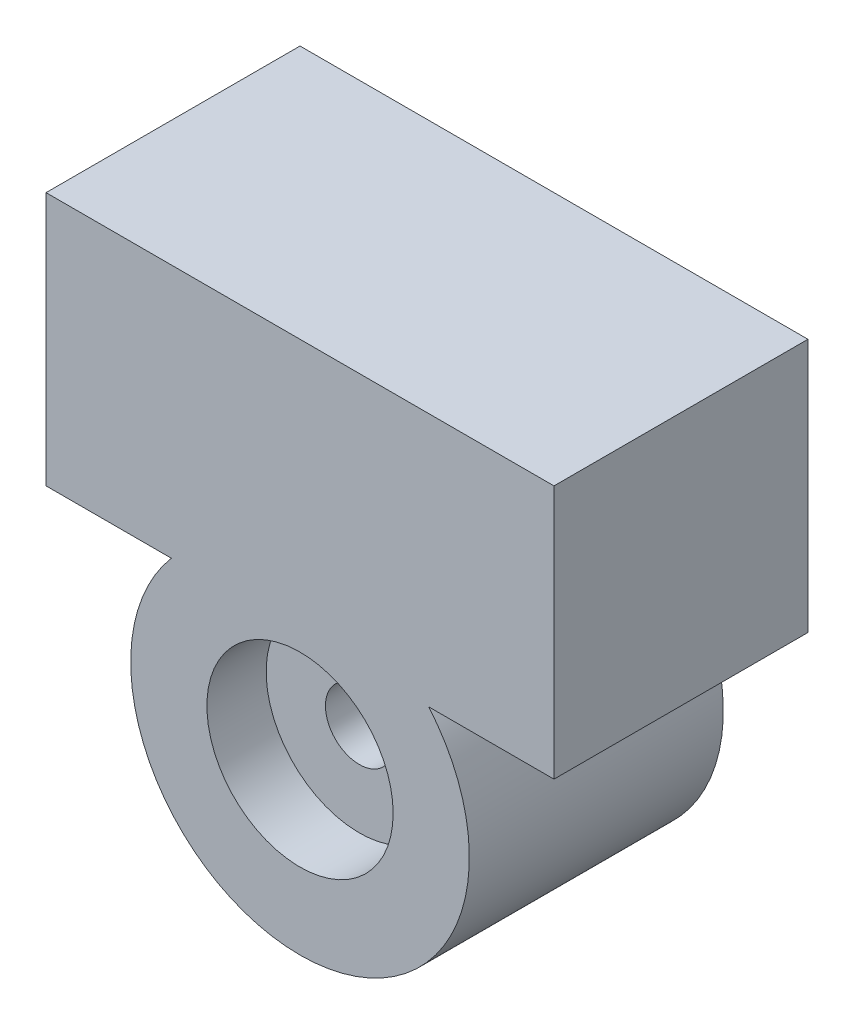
from build123d import *

# Parameters (mm, degrees)
SALIENTE_EXTRUIR1_DEPTH    = 30
CROQUIS2_R                 = 11
CORTAR_EXTRUIR1_DEPTH      = 7
CORTAR_EXTRUIR2_DEPTH      = 58.254510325
CORTAR_EXTRUIR2_DEPTH_BACK = 58.254510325
CROQUIS3_R                 = 4


with BuildPart() as part:
    # Croquis1 → Saliente-Extruir1 (new body)
    with BuildSketch(Plane.XY):
        with BuildLine():
            Line((-15.198684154, 13), (-30.001315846, 13))
            Line((-30.001315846, 13), (-30.001315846, 43))
            Line((-30.001315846, 43), (29.998684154, 43))
            Line((29.998684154, 43), (29.998684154, 13))
            Line((29.998684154, 13), (15.198684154, 13))
            ThreePointArc((15.198684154, 13), (0, -20), (-15.198684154, 13))
        make_face()
    extrude(amount=SALIENTE_EXTRUIR1_DEPTH)

    # Croquis2 → Cortar-Extruir1 (cut)
    with BuildSketch(Plane.XY.offset(30)):
        Circle(CROQUIS2_R)
    extrude(amount=-CORTAR_EXTRUIR1_DEPTH, mode=Mode.SUBTRACT)

    # Croquis3 → Cortar-Extruir2 (cut, two sides: drawn at the far end of the back side and taken through both)
    with BuildSketch(Plane.XY.offset(23).offset(-CORTAR_EXTRUIR2_DEPTH_BACK)):
        Circle(CROQUIS3_R)
    extrude(amount=CORTAR_EXTRUIR2_DEPTH + CORTAR_EXTRUIR2_DEPTH_BACK, mode=Mode.SUBTRACT)


solid = part.part
